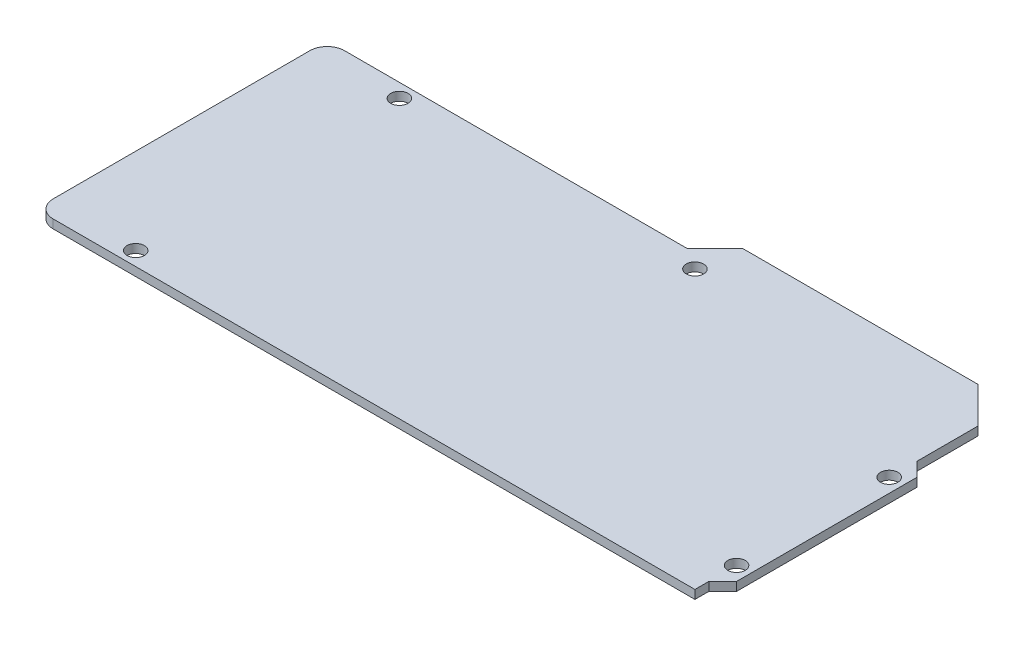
from build123d import *

# Parameters (mm, degrees)
BOSS_EXTRUDE1_DEPTH          = 1.5875
F_1_8_0_125_DIAMETER_HOLE1_D = 3.175


with BuildPart() as part:
    # Sketch1 → Boss-Extrude1 (new body)
    with BuildSketch(Plane(origin=(0, 0, 0), x_dir=(1, 0, 0), z_dir=(0, 1, 0))):
        with BuildLine():
            Line((120.65, 2.54), (123.19, 5.08))
            Line((123.19, 5.08), (123.19, 38.1))
            Line((123.19, 38.1), (120.65, 40.64))
            Line((120.65, 40.64), (120.65, 51.816))
            Line((120.65, 51.816), (114.046, 58.42))
            Line((114.046, 58.42), (70.993, 58.42))
            Line((70.993, 58.42), (65.913, 53.34))
            Line((65.913, 53.34), (3.175, 53.34))
            ThreePointArc((3.175, 53.34), (0.92993597, 52.41006403), (0, 50.165))
            Line((0, 50.165), (0, 3.175))
            ThreePointArc((0, 3.175), (0.92993597, 0.92993597), (3.175, 0))
            Line((3.175, 0), (120.65, 0))
            Line((120.65, 0), (120.65, 2.54))
        make_face()
    extrude(amount=BOSS_EXTRUDE1_DEPTH)

    # 1_8 _0.125_ Diameter Hole1 (through all)
    with Locations(Plane(origin=(15.748, 1.5875, -50.8), x_dir=(0, 0, 1), z_dir=(0, 1, 0))):
        with Locations((0, 0), (48.26, 0), (0, 54.102), (15.24, 104.902), (43.18, 104.902)):
            Hole(F_1_8_0_125_DIAMETER_HOLE1_D / 2)


solid = part.part
